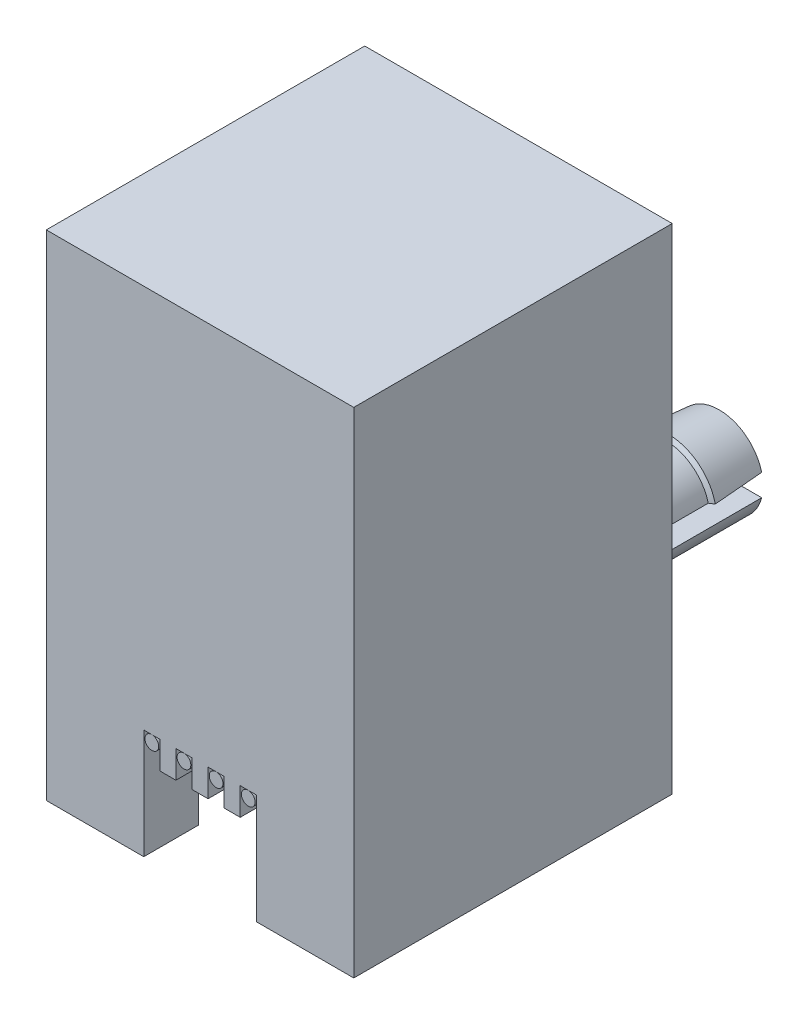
from build123d import *

# Parameters (mm, degrees)
SKETCH1_W          = 11.2
SKETCH1_H          = 11.6
EXTRUDE1_DEPTH     = 9
CUT_EXTRUDE1_DEPTH = 10
SKETCH3_W          = 4.1
SKETCH3_H          = 3
CUT_EXTRUDE2_DEPTH = 2
CUT_EXTRUDE3_DEPTH = 1
EXTRUDE2_DEPTH     = 3.5
SKETCH9_W          = 0.585714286
SKETCH9_H          = 1
CUT_EXTRUDE4_DEPTH = 2
SKETCH10_W         = 4.8
SKETCH10_H         = 4.3
CUT_EXTRUDE5_DEPTH = 0.3
SKETCH11_W         = 0.585714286
SKETCH11_H         = 5.95
CUT_EXTRUDE6_DEPTH = 0.6
SKETCH13_R         = 0.25
LPATTERN2_COUNT    = 4
LPATTERN2_PITCH    = 1.1714


with BuildPart() as part:
    # Sketch1 → Extrude1 (new, symmetric)
    with BuildSketch(Plane(origin=(0, 0, 0), x_dir=(1, 0, 0), z_dir=(0, 1, 0))):
        Rectangle(SKETCH1_W, SKETCH1_H)
    extrude(amount=EXTRUDE1_DEPTH, both=True)

    # Sketch2 → Cut-Extrude1 (cut)
    with BuildSketch(Plane.XZ.offset(9)):
        Polygon((4, 3.8), (-4, 3.8), (-4, -3), (-2.9, -3), (-2.9, -4.8), (2.9, -4.8), (2.9, -3), (4, -3), align=None)
    extrude(amount=-CUT_EXTRUDE1_DEPTH, mode=Mode.SUBTRACT)

    # Sketch3 → Cut-Extrude2 (cut)
    with BuildSketch(Plane.XY.offset(5.8)):
        with Locations((0, -7.5)):
            Rectangle(SKETCH3_W, SKETCH3_H)
    extrude(amount=-CUT_EXTRUDE2_DEPTH, mode=Mode.SUBTRACT)

    # Sketch4 → Cut-Extrude3 (cut)
    with BuildSketch(Plane(origin=(0, 0, -5.8), x_dir=(-1, 0, 0), z_dir=(0, 0, -1))):
        Polygon((1.5, -7.2), (1.5, -9), (-1.5, -9), (-1.5, -7.2), (-2.9, -7.2), (-2.9, -4.2), (2.9, -4.2), (2.9, -7.2), align=None)
    extrude(amount=-CUT_EXTRUDE3_DEPTH, mode=Mode.SUBTRACT)

    # Sketch5 → Extrude2 (add)
    with BuildSketch(Plane(origin=(0, 0, -5.8), x_dir=(-1, 0, 0), z_dir=(0, 0, -1))):
        with BuildLine():
            Line((-5.359193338, -1.52), (-2.260806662, -1.52))
            ThreePointArc((-2.260806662, -1.52), (-3.81, -2.72), (-5.359193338, -1.52))
        make_face()
        with BuildLine():
            Line((-5.359193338, -0.72), (-2.260806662, -0.72))
            ThreePointArc((-2.260806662, -0.72), (-3.81, 0.48), (-5.359193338, -0.72))
        make_face()
    extrude2 = extrude(amount=EXTRUDE2_DEPTH)

    # Sketch8 for Loft1 → Loft1 section 0
    with BuildSketch(Plane(origin=(0, 0, -9.3), x_dir=(-1, 0, 0), z_dir=(0, 0, -1))):
        with BuildLine():
            Line((-5.359193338, -0.72), (-2.260806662, -0.72))
            # circular arc as an exact rational Bezier (weights 1, cos(half-angle), 1)
            Bezier((-2.260806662, -0.72), (-3.81, 5.28), (-5.359193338, -0.72), weights=[1, 0.25, 1])
        make_face()
    # Sketch6 for Loft1 → Loft1 section 1
    with BuildSketch(Plane(origin=(0, 0, -7.4537), x_dir=(-1, 0, 0), z_dir=(0, 0, -1))):
        with BuildLine():
            Line((-5.513672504, -0.72), (-2.106327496, -0.72))
            Bezier((-2.106327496, -0.72), (-3.81, 6.53625), (-5.513672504, -0.72), weights=[1, 0.228571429, 1])
        make_face()
    loft1 = loft()

    # Sketch6_2 for Loft2 → Loft2 section 0
    with BuildSketch(Plane(origin=(0, 0, -7.4537), x_dir=(-1, 0, 0), z_dir=(0, 0, -1))):
        with BuildLine():
            Line((-5.513672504, -0.72), (-2.106327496, -0.72))
            Bezier((-2.106327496, -0.72), (-3.81, 6.53625), (-5.513672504, -0.72), weights=[1, 0.228571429, 1])
        make_face()
    # Sketch7 for Loft2 → Loft2 section 1
    with BuildSketch(Plane(origin=(0, 0, -7.3537), x_dir=(-1, 0, 0), z_dir=(0, 0, -1))):
        with BuildLine():
            Line((-5.359193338, -0.72), (-2.260806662, -0.72))
            Bezier((-2.260806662, -0.72), (-3.81, 5.28), (-5.359193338, -0.72), weights=[1, 0.25, 1])
        make_face()
    loft2 = loft()

    # Mirror1: Extrude2, Loft1, Loft2 across plane
    add(extrude2.mirror(Plane(origin=(0, 0, 0), x_dir=(0, 0, 1), z_dir=(1, 0, 0))))
    add(loft1.mirror(Plane(origin=(0, 0, 0), x_dir=(0, 0, 1), z_dir=(1, 0, 0))))
    add(loft2.mirror(Plane(origin=(0, 0, 0), x_dir=(0, 0, 1), z_dir=(1, 0, 0))))

    # Sketch9 → Cut-Extrude4 (cut)
    with BuildSketch(Plane(origin=(0, 0, 3.8), x_dir=(-1, 0, 0), z_dir=(0, 0, -1))):
        with Locations((1.757142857, -5.5)):
            Rectangle(SKETCH9_W, SKETCH9_H)
        with Locations((-1.757142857, -5.5)):
            Rectangle(SKETCH9_W, SKETCH9_H)
        with Locations((0.585714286, -5.5)):
            Rectangle(SKETCH9_W, SKETCH9_H)
        with Locations((-0.585714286, -5.5)):
            Rectangle(SKETCH9_W, SKETCH9_H)
    extrude(amount=-CUT_EXTRUDE4_DEPTH, mode=Mode.SUBTRACT)

    # Sketch10 → Cut-Extrude5 (cut)
    with BuildSketch(Plane.XZ.offset(-1)):
        with Locations((0, -2.15)):
            Rectangle(SKETCH10_W, SKETCH10_H)
    extrude(amount=-CUT_EXTRUDE5_DEPTH, mode=Mode.SUBTRACT)

    # Sketch11 → Cut-Extrude6 (cut)
    with BuildSketch(Plane.XZ.offset(-1)):
        with Locations((-1.757142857, 0.825)):
            Rectangle(SKETCH11_W, SKETCH11_H)
        with Locations((-0.585714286, 0.825)):
            Rectangle(SKETCH11_W, SKETCH11_H)
        with Locations((0.585714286, 0.825)):
            Rectangle(SKETCH11_W, SKETCH11_H)
        with Locations((1.757142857, 0.825)):
            Rectangle(SKETCH11_W, SKETCH11_H)
    extrude(amount=-CUT_EXTRUDE6_DEPTH, mode=Mode.SUBTRACT)


with BuildPart() as body_2:
    # Sweep1: sweep along a path in Sketch12
    with BuildLine(Plane(origin=(-1.757142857, 0, 0), x_dir=(0, 0, -1), z_dir=(1, 0, 0))) as sweep1_path:
        Line((-5.8, -5), (-4.219549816, -5))
        ThreePointArc((-4.219549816, -5), (-3.898156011, -4.883022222), (-3.727145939, -4.586824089))
        Line((-3.727145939, -4.586824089), (-2.636241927, 1.6))
    # Sketch13 → Sweep1 (sweep)
    with BuildSketch(Plane.XY.offset(5.8)):
        with Locations((-1.757142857, -5.25)):
            Circle(SKETCH13_R)
    sweep(path=sweep1_path.line)


with BuildPart() as lpattern2_1:
    # LPattern2: pattern copy
    add(body_2.part.moved(Location(Vector(1, 0, 0) * (1 * LPATTERN2_PITCH))))


with BuildPart() as lpattern2_2:
    # LPattern2: pattern copy
    add(body_2.part.moved(Location(Vector(1, 0, 0) * (2 * LPATTERN2_PITCH))))


with BuildPart() as lpattern2_3:
    # LPattern2: pattern copy
    add(body_2.part.moved(Location(Vector(1, 0, 0) * (3 * LPATTERN2_PITCH))))


solid = Compound([part.part, body_2.part, lpattern2_1.part, lpattern2_2.part, lpattern2_3.part])
